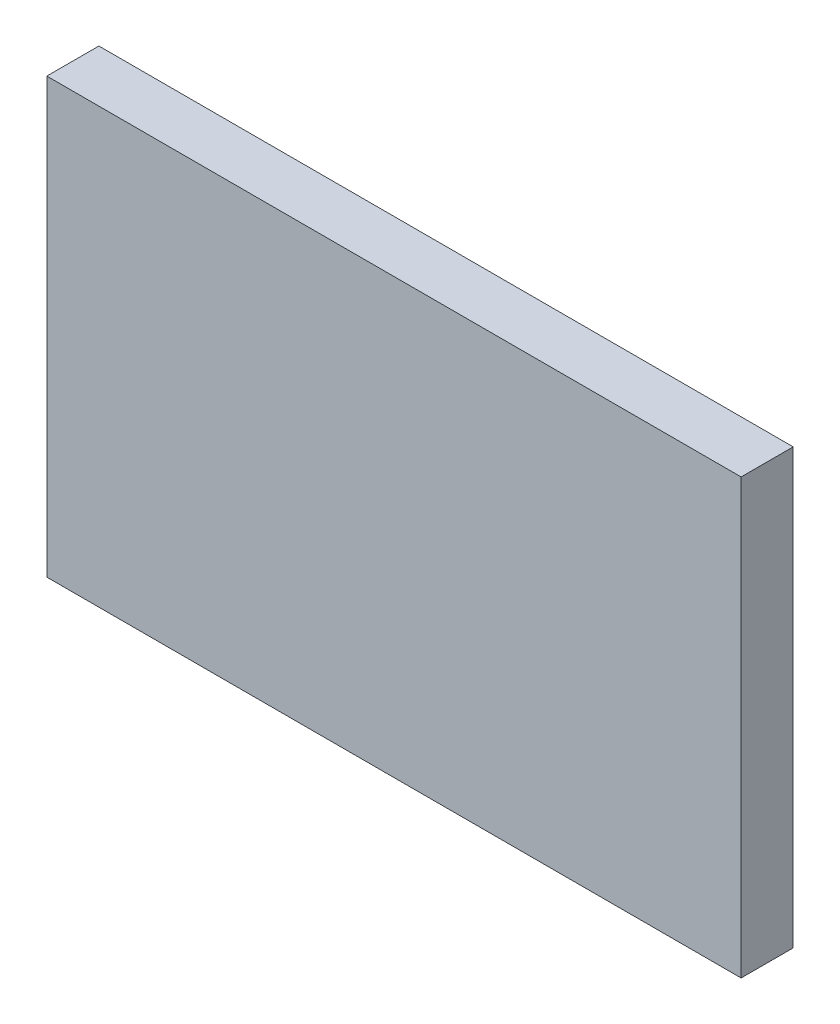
ISO-10303-21;
HEADER;
FILE_DESCRIPTION(('STEP AP214'),'2;1');
FILE_NAME('part.step','',(''),(''),'','','');
FILE_SCHEMA(('AUTOMOTIVE_DESIGN { 1 0 10303 214 1 1 1 1 }'));
ENDSEC;
DATA;
#1=APPLICATION_CONTEXT('core data for automotive mechanical design processes');
#2=APPLICATION_PROTOCOL_DEFINITION('international standard','automotive_design',2000,#1);
#3=PRODUCT_CONTEXT('',#1,'mechanical');
#4=PRODUCT('Part','Part','',(#3));
#5=PRODUCT_RELATED_PRODUCT_CATEGORY('part','',(#4));
#6=PRODUCT_DEFINITION_FORMATION('','',#4);
#7=PRODUCT_DEFINITION_CONTEXT('part definition',#1,'design');
#8=PRODUCT_DEFINITION('design','',#6,#7);
#9=PRODUCT_DEFINITION_SHAPE('','',#8);
#10=(LENGTH_UNIT() NAMED_UNIT(*) SI_UNIT(.MILLI.,.METRE.));
#11=(NAMED_UNIT(*) PLANE_ANGLE_UNIT() SI_UNIT($,.RADIAN.));
#12=(NAMED_UNIT(*) SI_UNIT($,.STERADIAN.) SOLID_ANGLE_UNIT());
#13=UNCERTAINTY_MEASURE_WITH_UNIT(LENGTH_MEASURE(1.E-05),#10,'distance_accuracy_value','');
#14=(GEOMETRIC_REPRESENTATION_CONTEXT(3) GLOBAL_UNCERTAINTY_ASSIGNED_CONTEXT((#13)) GLOBAL_UNIT_ASSIGNED_CONTEXT((#10,
#11,#12)) REPRESENTATION_CONTEXT('',''));
#15=CARTESIAN_POINT('',(0.,0.,0.));
#16=DIRECTION('',(0.,0.,1.));
#17=DIRECTION('',(1.,0.,0.));
#18=AXIS2_PLACEMENT_3D('',#15,#16,#17);
#19=CARTESIAN_POINT('',(58.42,41.275,-20.32));
#20=DIRECTION('',(1.,0.,0.));
#21=DIRECTION('',(0.,0.,-1.));
#22=AXIS2_PLACEMENT_3D('',#19,#20,#21);
#23=PLANE('',#22);
#24=DIRECTION('',(0.,0.,1.));
#25=VECTOR('',#24,1.);
#26=CARTESIAN_POINT('',(58.42,41.275,-20.32));
#27=LINE('',#26,#25);
#28=CARTESIAN_POINT('',(58.42,41.275,-15.24));
#29=VERTEX_POINT('',#28);
#30=CARTESIAN_POINT('',(58.42,41.275,-5.08));
#31=VERTEX_POINT('',#30);
#32=EDGE_CURVE('E544',#29,#31,#27,.T.);
#33=ORIENTED_EDGE('',*,*,#32,.F.);
#34=CARTESIAN_POINT('',(58.42,36.195,-15.24));
#35=DIRECTION('',(1.,0.,0.));
#36=DIRECTION('',(0.,0.,-1.));
#37=AXIS2_PLACEMENT_3D('',#34,#35,#36);
#38=CIRCLE('',#37,5.08);
#39=CARTESIAN_POINT('',(58.42,36.195,-20.32));
#40=VERTEX_POINT('',#39);
#41=EDGE_CURVE('E245',#29,#40,#38,.F.);
#42=ORIENTED_EDGE('',*,*,#41,.T.);
#43=DIRECTION('',(0.,1.,0.));
#44=VECTOR('',#43,1.);
#45=CARTESIAN_POINT('',(58.42,41.275,-20.32));
#46=LINE('',#45,#44);
#47=CARTESIAN_POINT('',(58.42,27.1108538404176,-20.32));
#48=VERTEX_POINT('',#47);
#49=EDGE_CURVE('E538',#48,#40,#46,.T.);
#50=ORIENTED_EDGE('',*,*,#49,.F.);
#51=CARTESIAN_POINT('',(58.42,27.1108538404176,-15.24));
#52=DIRECTION('',(1.,0.,0.));
#53=DIRECTION('',(0.,0.,-1.));
#54=AXIS2_PLACEMENT_3D('',#51,#52,#53);
#55=CIRCLE('',#54,5.08);
#56=CARTESIAN_POINT('',(58.42,22.0308538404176,-15.24));
#57=VERTEX_POINT('',#56);
#58=EDGE_CURVE('E243',#48,#57,#55,.F.);
#59=ORIENTED_EDGE('',*,*,#58,.T.);
#60=DIRECTION('',(0.,0.,1.));
#61=VECTOR('',#60,1.);
#62=CARTESIAN_POINT('',(58.42,22.0308538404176,-20.32));
#63=LINE('',#62,#61);
#64=CARTESIAN_POINT('',(58.42,22.0308538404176,-5.08));
#65=VERTEX_POINT('',#64);
#66=EDGE_CURVE('E198',#57,#65,#63,.T.);
#67=ORIENTED_EDGE('',*,*,#66,.T.);
#68=CARTESIAN_POINT('',(58.42,16.9508538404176,-5.08));
#69=DIRECTION('',(1.,0.,0.));
#70=DIRECTION('',(0.,0.,-1.));
#71=AXIS2_PLACEMENT_3D('',#68,#69,#70);
#72=CIRCLE('',#71,5.08);
#73=CARTESIAN_POINT('',(58.42,16.9508538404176,0.));
#74=VERTEX_POINT('',#73);
#75=EDGE_CURVE('E284',#65,#74,#72,.T.);
#76=ORIENTED_EDGE('',*,*,#75,.T.);
#77=DIRECTION('',(0.,1.,0.));
#78=VECTOR('',#77,1.);
#79=CARTESIAN_POINT('',(58.42,41.275,0.));
#80=LINE('',#79,#78);
#81=CARTESIAN_POINT('',(58.42,46.355,0.));
#82=VERTEX_POINT('',#81);
#83=EDGE_CURVE('E528',#74,#82,#80,.T.);
#84=ORIENTED_EDGE('',*,*,#83,.T.);
#85=CARTESIAN_POINT('',(58.42,46.355,-5.08));
#86=DIRECTION('',(1.,0.,0.));
#87=DIRECTION('',(0.,0.,-1.));
#88=AXIS2_PLACEMENT_3D('',#85,#86,#87);
#89=CIRCLE('',#88,5.08);
#90=EDGE_CURVE('E277',#82,#31,#89,.T.);
#91=ORIENTED_EDGE('',*,*,#90,.T.);
#92=EDGE_LOOP('',(#33,#42,#50,#59,#67,#76,#84,#91));
#93=FACE_BOUND('',#92,.T.);
#94=CARTESIAN_POINT('',(58.4200000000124,31.75,-12.7));
#95=DIRECTION('',(1.,0.,0.));
#96=DIRECTION('',(0.,0.,-1.));
#97=AXIS2_PLACEMENT_3D('',#94,#95,#96);
#98=CIRCLE('',#97,6.33033884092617);
#99=CARTESIAN_POINT('',(58.4200000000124,31.75,-19.0303388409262));
#100=VERTEX_POINT('',#99);
#101=EDGE_CURVE('E11',#100,#100,#98,.F.);
#102=ORIENTED_EDGE('',*,*,#101,.F.);
#103=EDGE_LOOP('',(#102));
#104=FACE_BOUND('',#103,.T.);
#105=ADVANCED_FACE('F30',(#93,#104),#23,.F.);
#106=CARTESIAN_POINT('',(43.18,41.275,-20.32));
#107=DIRECTION('',(-1.,0.,0.));
#108=DIRECTION('',(0.,0.,1.));
#109=AXIS2_PLACEMENT_3D('',#106,#107,#108);
#110=PLANE('',#109);
#111=DIRECTION('',(0.,-1.,0.));
#112=VECTOR('',#111,1.);
#113=CARTESIAN_POINT('',(43.18,41.275,-20.32));
#114=LINE('',#113,#112);
#115=CARTESIAN_POINT('',(43.18,36.195,-20.32));
#116=VERTEX_POINT('',#115);
#117=CARTESIAN_POINT('',(43.18,27.305,-20.32));
#118=VERTEX_POINT('',#117);
#119=EDGE_CURVE('E573',#116,#118,#114,.T.);
#120=ORIENTED_EDGE('',*,*,#119,.F.);
#121=CARTESIAN_POINT('',(43.18,36.195,-15.24));
#122=DIRECTION('',(-1.,0.,0.));
#123=DIRECTION('',(0.,0.,1.));
#124=AXIS2_PLACEMENT_3D('',#121,#122,#123);
#125=CIRCLE('',#124,5.08);
#126=CARTESIAN_POINT('',(43.18,41.275,-15.24));
#127=VERTEX_POINT('',#126);
#128=EDGE_CURVE('E255',#116,#127,#125,.F.);
#129=ORIENTED_EDGE('',*,*,#128,.T.);
#130=DIRECTION('',(0.,0.,1.));
#131=VECTOR('',#130,1.);
#132=CARTESIAN_POINT('',(43.18,41.275,-20.32));
#133=LINE('',#132,#131);
#134=CARTESIAN_POINT('',(43.18,41.275,-5.08));
#135=VERTEX_POINT('',#134);
#136=EDGE_CURVE('E567',#127,#135,#133,.T.);
#137=ORIENTED_EDGE('',*,*,#136,.T.);
#138=CARTESIAN_POINT('',(43.18,46.355,-5.08));
#139=DIRECTION('',(-1.,0.,0.));
#140=DIRECTION('',(0.,0.,1.));
#141=AXIS2_PLACEMENT_3D('',#138,#139,#140);
#142=CIRCLE('',#141,5.08);
#143=CARTESIAN_POINT('',(43.18,46.355,0.));
#144=VERTEX_POINT('',#143);
#145=EDGE_CURVE('E279',#135,#144,#142,.T.);
#146=ORIENTED_EDGE('',*,*,#145,.T.);
#147=DIRECTION('',(0.,-1.,0.));
#148=VECTOR('',#147,1.);
#149=CARTESIAN_POINT('',(43.18,41.275,0.));
#150=LINE('',#149,#148);
#151=CARTESIAN_POINT('',(43.18,17.145,0.));
#152=VERTEX_POINT('',#151);
#153=EDGE_CURVE('E523',#144,#152,#150,.T.);
#154=ORIENTED_EDGE('',*,*,#153,.T.);
#155=CARTESIAN_POINT('',(43.18,17.145,-5.08));
#156=DIRECTION('',(-1.,0.,0.));
#157=DIRECTION('',(0.,0.,1.));
#158=AXIS2_PLACEMENT_3D('',#155,#156,#157);
#159=CIRCLE('',#158,5.08);
#160=CARTESIAN_POINT('',(43.18,22.225,-5.08));
#161=VERTEX_POINT('',#160);
#162=EDGE_CURVE('E290',#152,#161,#159,.T.);
#163=ORIENTED_EDGE('',*,*,#162,.T.);
#164=DIRECTION('',(0.,0.,1.));
#165=VECTOR('',#164,1.);
#166=CARTESIAN_POINT('',(43.18,22.225,-20.32));
#167=LINE('',#166,#165);
#168=CARTESIAN_POINT('',(43.18,22.225,-15.24));
#169=VERTEX_POINT('',#168);
#170=EDGE_CURVE('E521',#169,#161,#167,.T.);
#171=ORIENTED_EDGE('',*,*,#170,.F.);
#172=CARTESIAN_POINT('',(43.18,27.305,-15.24));
#173=DIRECTION('',(-1.,0.,0.));
#174=DIRECTION('',(0.,0.,1.));
#175=AXIS2_PLACEMENT_3D('',#172,#173,#174);
#176=CIRCLE('',#175,5.08);
#177=EDGE_CURVE('E253',#169,#118,#176,.F.);
#178=ORIENTED_EDGE('',*,*,#177,.T.);
#179=EDGE_LOOP('',(#120,#129,#137,#146,#154,#163,#171,#178));
#180=FACE_BOUND('',#179,.T.);
#181=CARTESIAN_POINT('',(43.1800000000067,31.75,-12.7));
#182=DIRECTION('',(-1.,0.,0.));
#183=DIRECTION('',(0.,0.,1.));
#184=AXIS2_PLACEMENT_3D('',#181,#182,#183);
#185=CIRCLE('',#184,6.33033884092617);
#186=CARTESIAN_POINT('',(43.1800000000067,31.75,-6.36966115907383));
#187=VERTEX_POINT('',#186);
#188=EDGE_CURVE('E38',#187,#187,#185,.F.);
#189=ORIENTED_EDGE('',*,*,#188,.F.);
#190=EDGE_LOOP('',(#189));
#191=FACE_BOUND('',#190,.T.);
#192=ADVANCED_FACE('F296',(#180,#191),#110,.F.);
#193=CARTESIAN_POINT('',(0.,63.5,0.));
#194=DIRECTION('',(0.,0.,-1.));
#195=DIRECTION('',(-1.,0.,0.));
#196=AXIS2_PLACEMENT_3D('',#193,#194,#195);
#197=PLANE('',#196);
#198=DIRECTION('',(0.,-1.,0.));
#199=VECTOR('',#198,1.);
#200=CARTESIAN_POINT('',(63.5,41.275,0.));
#201=LINE('',#200,#199);
#202=CARTESIAN_POINT('',(63.5,46.355,0.));
#203=VERTEX_POINT('',#202);
#204=CARTESIAN_POINT('',(63.5,16.9508538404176,0.));
#205=VERTEX_POINT('',#204);
#206=EDGE_CURVE('E525',#203,#205,#201,.T.);
#207=ORIENTED_EDGE('',*,*,#206,.F.);
#208=DIRECTION('',(1.,0.,0.));
#209=VECTOR('',#208,1.);
#210=CARTESIAN_POINT('',(0.,46.3550000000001,0.));
#211=LINE('',#210,#209);
#212=EDGE_CURVE('E230',#203,#82,#211,.F.);
#213=ORIENTED_EDGE('',*,*,#212,.T.);
#214=ORIENTED_EDGE('',*,*,#83,.F.);
#215=DIRECTION('',(-1.,0.,0.));
#216=VECTOR('',#215,1.);
#217=CARTESIAN_POINT('',(0.,16.9508538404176,0.));
#218=LINE('',#217,#216);
#219=EDGE_CURVE('E224',#74,#205,#218,.F.);
#220=ORIENTED_EDGE('',*,*,#219,.T.);
#221=EDGE_LOOP('',(#207,#213,#214,#220));
#222=FACE_BOUND('',#221,.T.);
#223=DIRECTION('',(0.,-1.,0.));
#224=VECTOR('',#223,1.);
#225=CARTESIAN_POINT('',(0.,0.,0.));
#226=LINE('',#225,#224);
#227=CARTESIAN_POINT('',(0.,63.5,0.));
#228=VERTEX_POINT('',#227);
#229=CARTESIAN_POINT('',(0.,0.,0.));
#230=VERTEX_POINT('',#229);
#231=EDGE_CURVE('E176',#228,#230,#226,.T.);
#232=ORIENTED_EDGE('',*,*,#231,.F.);
#233=DIRECTION('',(-1.,0.,0.));
#234=VECTOR('',#233,1.);
#235=CARTESIAN_POINT('',(0.,63.5,0.));
#236=LINE('',#235,#234);
#237=CARTESIAN_POINT('',(101.6,63.5,0.));
#238=VERTEX_POINT('',#237);
#239=EDGE_CURVE('E203',#238,#228,#236,.T.);
#240=ORIENTED_EDGE('',*,*,#239,.F.);
#241=DIRECTION('',(0.,1.,0.));
#242=VECTOR('',#241,1.);
#243=CARTESIAN_POINT('',(101.6,0.,0.));
#244=LINE('',#243,#242);
#245=CARTESIAN_POINT('',(101.6,0.,0.));
#246=VERTEX_POINT('',#245);
#247=EDGE_CURVE('E177',#246,#238,#244,.T.);
#248=ORIENTED_EDGE('',*,*,#247,.F.);
#249=DIRECTION('',(1.,0.,0.));
#250=VECTOR('',#249,1.);
#251=CARTESIAN_POINT('',(0.,0.,0.));
#252=LINE('',#251,#250);
#253=EDGE_CURVE('E170',#230,#246,#252,.T.);
#254=ORIENTED_EDGE('',*,*,#253,.F.);
#255=EDGE_LOOP('',(#232,#240,#248,#254));
#256=FACE_BOUND('',#255,.T.);
#257=ORIENTED_EDGE('',*,*,#153,.F.);
#258=DIRECTION('',(1.,0.,0.));
#259=VECTOR('',#258,1.);
#260=CARTESIAN_POINT('',(0.,46.355,0.));
#261=LINE('',#260,#259);
#262=CARTESIAN_POINT('',(38.1,46.355,0.));
#263=VERTEX_POINT('',#262);
#264=EDGE_CURVE('E227',#144,#263,#261,.F.);
#265=ORIENTED_EDGE('',*,*,#264,.T.);
#266=DIRECTION('',(0.,1.,0.));
#267=VECTOR('',#266,1.);
#268=CARTESIAN_POINT('',(38.1,41.275,0.));
#269=LINE('',#268,#267);
#270=CARTESIAN_POINT('',(38.1,17.145,0.));
#271=VERTEX_POINT('',#270);
#272=EDGE_CURVE('E576',#271,#263,#269,.T.);
#273=ORIENTED_EDGE('',*,*,#272,.F.);
#274=DIRECTION('',(-1.,0.,0.));
#275=VECTOR('',#274,1.);
#276=CARTESIAN_POINT('',(0.,17.145,0.));
#277=LINE('',#276,#275);
#278=EDGE_CURVE('E221',#271,#152,#277,.F.);
#279=ORIENTED_EDGE('',*,*,#278,.T.);
#280=EDGE_LOOP('',(#257,#265,#273,#279));
#281=FACE_BOUND('',#280,.T.);
#282=ADVANCED_FACE('F172',(#222,#256,#281),#197,.T.);
#283=CARTESIAN_POINT('',(0.,0.,7.62));
#284=DIRECTION('',(1.,0.,0.));
#285=DIRECTION('',(0.,1.,0.));
#286=AXIS2_PLACEMENT_3D('',#283,#284,#285);
#287=PLANE('',#286);
#288=ORIENTED_EDGE('',*,*,#231,.T.);
#289=DIRECTION('',(0.,0.,-1.));
#290=VECTOR('',#289,1.);
#291=CARTESIAN_POINT('',(0.,0.,7.62));
#292=LINE('',#291,#290);
#293=CARTESIAN_POINT('',(0.,0.,7.62));
#294=VERTEX_POINT('',#293);
#295=EDGE_CURVE('E183',#294,#230,#292,.T.);
#296=ORIENTED_EDGE('',*,*,#295,.F.);
#297=DIRECTION('',(0.,-1.,0.));
#298=VECTOR('',#297,1.);
#299=CARTESIAN_POINT('',(0.,0.,7.62));
#300=LINE('',#299,#298);
#301=CARTESIAN_POINT('',(0.,63.5,7.62));
#302=VERTEX_POINT('',#301);
#303=EDGE_CURVE('E205',#302,#294,#300,.T.);
#304=ORIENTED_EDGE('',*,*,#303,.F.);
#305=DIRECTION('',(0.,0.,-1.));
#306=VECTOR('',#305,1.);
#307=CARTESIAN_POINT('',(0.,63.5,7.62));
#308=LINE('',#307,#306);
#309=EDGE_CURVE('E194',#302,#228,#308,.T.);
#310=ORIENTED_EDGE('',*,*,#309,.T.);
#311=EDGE_LOOP('',(#288,#296,#304,#310));
#312=FACE_BOUND('',#311,.T.);
#313=ADVANCED_FACE('F32',(#312),#287,.F.);
#314=CARTESIAN_POINT('',(0.,0.,7.62));
#315=DIRECTION('',(0.,1.,0.));
#316=DIRECTION('',(0.,0.,1.));
#317=AXIS2_PLACEMENT_3D('',#314,#315,#316);
#318=PLANE('',#317);
#319=ORIENTED_EDGE('',*,*,#253,.T.);
#320=DIRECTION('',(0.,0.,-1.));
#321=VECTOR('',#320,1.);
#322=CARTESIAN_POINT('',(101.6,0.,7.62));
#323=LINE('',#322,#321);
#324=CARTESIAN_POINT('',(101.6,0.,7.62));
#325=VERTEX_POINT('',#324);
#326=EDGE_CURVE('E190',#325,#246,#323,.T.);
#327=ORIENTED_EDGE('',*,*,#326,.F.);
#328=DIRECTION('',(1.,0.,0.));
#329=VECTOR('',#328,1.);
#330=CARTESIAN_POINT('',(0.,0.,7.62));
#331=LINE('',#330,#329);
#332=EDGE_CURVE('E185',#294,#325,#331,.T.);
#333=ORIENTED_EDGE('',*,*,#332,.F.);
#334=ORIENTED_EDGE('',*,*,#295,.T.);
#335=EDGE_LOOP('',(#319,#327,#333,#334));
#336=FACE_BOUND('',#335,.T.);
#337=ADVANCED_FACE('F184',(#336),#318,.F.);
#338=CARTESIAN_POINT('',(101.6,0.,7.62));
#339=DIRECTION('',(-1.,0.,0.));
#340=DIRECTION('',(0.,-1.,0.));
#341=AXIS2_PLACEMENT_3D('',#338,#339,#340);
#342=PLANE('',#341);
#343=ORIENTED_EDGE('',*,*,#247,.T.);
#344=DIRECTION('',(0.,0.,-1.));
#345=VECTOR('',#344,1.);
#346=CARTESIAN_POINT('',(101.6,63.5,7.62));
#347=LINE('',#346,#345);
#348=CARTESIAN_POINT('',(101.6,63.5,7.62));
#349=VERTEX_POINT('',#348);
#350=EDGE_CURVE('E213',#349,#238,#347,.T.);
#351=ORIENTED_EDGE('',*,*,#350,.F.);
#352=DIRECTION('',(0.,1.,0.));
#353=VECTOR('',#352,1.);
#354=CARTESIAN_POINT('',(101.6,0.,7.62));
#355=LINE('',#354,#353);
#356=EDGE_CURVE('E208',#325,#349,#355,.T.);
#357=ORIENTED_EDGE('',*,*,#356,.F.);
#358=ORIENTED_EDGE('',*,*,#326,.T.);
#359=EDGE_LOOP('',(#343,#351,#357,#358));
#360=FACE_BOUND('',#359,.T.);
#361=ADVANCED_FACE('F336',(#360),#342,.F.);
#362=CARTESIAN_POINT('',(0.,63.5,7.62));
#363=DIRECTION('',(0.,-1.,0.));
#364=DIRECTION('',(0.,0.,-1.));
#365=AXIS2_PLACEMENT_3D('',#362,#363,#364);
#366=PLANE('',#365);
#367=ORIENTED_EDGE('',*,*,#239,.T.);
#368=ORIENTED_EDGE('',*,*,#309,.F.);
#369=DIRECTION('',(-1.,0.,0.));
#370=VECTOR('',#369,1.);
#371=CARTESIAN_POINT('',(0.,63.5,7.62));
#372=LINE('',#371,#370);
#373=EDGE_CURVE('E210',#349,#302,#372,.T.);
#374=ORIENTED_EDGE('',*,*,#373,.F.);
#375=ORIENTED_EDGE('',*,*,#350,.T.);
#376=EDGE_LOOP('',(#367,#368,#374,#375));
#377=FACE_BOUND('',#376,.T.);
#378=ADVANCED_FACE('F332',(#377),#366,.F.);
#379=CARTESIAN_POINT('',(0.,63.5,7.62));
#380=DIRECTION('',(0.,0.,-1.));
#381=DIRECTION('',(-1.,0.,0.));
#382=AXIS2_PLACEMENT_3D('',#379,#380,#381);
#383=PLANE('',#382);
#384=ORIENTED_EDGE('',*,*,#303,.T.);
#385=ORIENTED_EDGE('',*,*,#332,.T.);
#386=ORIENTED_EDGE('',*,*,#356,.T.);
#387=ORIENTED_EDGE('',*,*,#373,.T.);
#388=EDGE_LOOP('',(#384,#385,#386,#387));
#389=FACE_BOUND('',#388,.T.);
#390=ADVANCED_FACE('F327',(#389),#383,.F.);
#391=CARTESIAN_POINT('',(63.5,41.275,-20.32));
#392=DIRECTION('',(-1.,0.,0.));
#393=DIRECTION('',(0.,0.,1.));
#394=AXIS2_PLACEMENT_3D('',#391,#392,#393);
#395=PLANE('',#394);
#396=DIRECTION('',(0.,-1.,0.));
#397=VECTOR('',#396,1.);
#398=CARTESIAN_POINT('',(63.5,41.275,-20.32));
#399=LINE('',#398,#397);
#400=CARTESIAN_POINT('',(63.5,36.195,-20.32));
#401=VERTEX_POINT('',#400);
#402=CARTESIAN_POINT('',(63.5,27.1108538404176,-20.32));
#403=VERTEX_POINT('',#402);
#404=EDGE_CURVE('E535',#401,#403,#399,.T.);
#405=ORIENTED_EDGE('',*,*,#404,.F.);
#406=CARTESIAN_POINT('',(63.5,36.195,-15.24));
#407=DIRECTION('',(-1.,0.,0.));
#408=DIRECTION('',(0.,0.,1.));
#409=AXIS2_PLACEMENT_3D('',#406,#407,#408);
#410=CIRCLE('',#409,5.08);
#411=CARTESIAN_POINT('',(63.5,41.275,-15.24));
#412=VERTEX_POINT('',#411);
#413=EDGE_CURVE('E241',#401,#412,#410,.F.);
#414=ORIENTED_EDGE('',*,*,#413,.T.);
#415=DIRECTION('',(0.,0.,1.));
#416=VECTOR('',#415,1.);
#417=CARTESIAN_POINT('',(63.5,41.275,-20.32));
#418=LINE('',#417,#416);
#419=CARTESIAN_POINT('',(63.5,41.275,-5.08));
#420=VERTEX_POINT('',#419);
#421=EDGE_CURVE('E541',#412,#420,#418,.T.);
#422=ORIENTED_EDGE('',*,*,#421,.T.);
#423=CARTESIAN_POINT('',(63.5,46.355,-5.08));
#424=DIRECTION('',(-1.,0.,0.));
#425=DIRECTION('',(0.,0.,1.));
#426=AXIS2_PLACEMENT_3D('',#423,#424,#425);
#427=CIRCLE('',#426,5.08);
#428=EDGE_CURVE('E274',#420,#203,#427,.T.);
#429=ORIENTED_EDGE('',*,*,#428,.T.);
#430=ORIENTED_EDGE('',*,*,#206,.T.);
#431=CARTESIAN_POINT('',(63.5,16.9508538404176,-5.08));
#432=DIRECTION('',(-1.,0.,0.));
#433=DIRECTION('',(0.,0.,1.));
#434=AXIS2_PLACEMENT_3D('',#431,#432,#433);
#435=CIRCLE('',#434,5.08);
#436=CARTESIAN_POINT('',(63.5,22.0308538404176,-5.08));
#437=VERTEX_POINT('',#436);
#438=EDGE_CURVE('E287',#205,#437,#435,.T.);
#439=ORIENTED_EDGE('',*,*,#438,.T.);
#440=DIRECTION('',(0.,0.,1.));
#441=VECTOR('',#440,1.);
#442=CARTESIAN_POINT('',(63.5,22.0308538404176,-20.32));
#443=LINE('',#442,#441);
#444=CARTESIAN_POINT('',(63.5,22.0308538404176,-15.24));
#445=VERTEX_POINT('',#444);
#446=EDGE_CURVE('E195',#445,#437,#443,.T.);
#447=ORIENTED_EDGE('',*,*,#446,.F.);
#448=CARTESIAN_POINT('',(63.5,27.1108538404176,-15.24));
#449=DIRECTION('',(-1.,0.,0.));
#450=DIRECTION('',(0.,0.,1.));
#451=AXIS2_PLACEMENT_3D('',#448,#449,#450);
#452=CIRCLE('',#451,5.08);
#453=EDGE_CURVE('E239',#445,#403,#452,.F.);
#454=ORIENTED_EDGE('',*,*,#453,.T.);
#455=EDGE_LOOP('',(#405,#414,#422,#429,#430,#439,#447,#454));
#456=FACE_BOUND('',#455,.T.);
#457=ADVANCED_FACE('F324',(#456),#395,.F.);
#458=CARTESIAN_POINT('',(63.5,22.0308538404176,-20.32));
#459=DIRECTION('',(0.,1.,0.));
#460=DIRECTION('',(0.,0.,1.));
#461=AXIS2_PLACEMENT_3D('',#458,#459,#460);
#462=PLANE('',#461);
#463=ORIENTED_EDGE('',*,*,#446,.T.);
#464=DIRECTION('',(-1.,0.,0.));
#465=VECTOR('',#464,1.);
#466=CARTESIAN_POINT('',(63.5,22.0308538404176,-5.08));
#467=LINE('',#466,#465);
#468=EDGE_CURVE('E267',#437,#65,#467,.T.);
#469=ORIENTED_EDGE('',*,*,#468,.T.);
#470=ORIENTED_EDGE('',*,*,#66,.F.);
#471=DIRECTION('',(-1.,0.,0.));
#472=VECTOR('',#471,1.);
#473=CARTESIAN_POINT('',(63.5,22.0308538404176,-15.24));
#474=LINE('',#473,#472);
#475=EDGE_CURVE('E265',#57,#445,#474,.F.);
#476=ORIENTED_EDGE('',*,*,#475,.T.);
#477=EDGE_LOOP('',(#463,#469,#470,#476));
#478=FACE_BOUND('',#477,.T.);
#479=ADVANCED_FACE('F319',(#478),#462,.F.);
#480=CARTESIAN_POINT('',(63.5,41.275,-20.32));
#481=DIRECTION('',(0.,-1.,0.));
#482=DIRECTION('',(1.,0.,0.));
#483=AXIS2_PLACEMENT_3D('',#480,#481,#482);
#484=PLANE('',#483);
#485=ORIENTED_EDGE('',*,*,#32,.T.);
#486=DIRECTION('',(1.,0.,0.));
#487=VECTOR('',#486,1.);
#488=CARTESIAN_POINT('',(63.5,41.275,-5.08));
#489=LINE('',#488,#487);
#490=EDGE_CURVE('E218',#31,#420,#489,.T.);
#491=ORIENTED_EDGE('',*,*,#490,.T.);
#492=ORIENTED_EDGE('',*,*,#421,.F.);
#493=DIRECTION('',(1.,0.,0.));
#494=VECTOR('',#493,1.);
#495=CARTESIAN_POINT('',(58.42,41.275,-15.24));
#496=LINE('',#495,#494);
#497=EDGE_CURVE('E189',#412,#29,#496,.F.);
#498=ORIENTED_EDGE('',*,*,#497,.T.);
#499=EDGE_LOOP('',(#485,#491,#492,#498));
#500=FACE_BOUND('',#499,.T.);
#501=ADVANCED_FACE('F316',(#500),#484,.F.);
#502=CARTESIAN_POINT('',(63.5,22.0308538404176,-20.32));
#503=DIRECTION('',(0.,0.,-1.));
#504=DIRECTION('',(-1.,0.,0.));
#505=AXIS2_PLACEMENT_3D('',#502,#503,#504);
#506=PLANE('',#505);
#507=ORIENTED_EDGE('',*,*,#49,.T.);
#508=DIRECTION('',(1.,0.,0.));
#509=VECTOR('',#508,1.);
#510=CARTESIAN_POINT('',(63.5,36.195,-20.32));
#511=LINE('',#510,#509);
#512=EDGE_CURVE('E236',#40,#401,#511,.T.);
#513=ORIENTED_EDGE('',*,*,#512,.T.);
#514=ORIENTED_EDGE('',*,*,#404,.T.);
#515=DIRECTION('',(-1.,0.,0.));
#516=VECTOR('',#515,1.);
#517=CARTESIAN_POINT('',(58.42,27.1108538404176,-20.32));
#518=LINE('',#517,#516);
#519=EDGE_CURVE('E233',#403,#48,#518,.T.);
#520=ORIENTED_EDGE('',*,*,#519,.T.);
#521=EDGE_LOOP('',(#507,#513,#514,#520));
#522=FACE_BOUND('',#521,.T.);
#523=ADVANCED_FACE('F313',(#522),#506,.T.);
#524=CARTESIAN_POINT('',(43.18,22.225,-20.32));
#525=DIRECTION('',(0.,1.,0.));
#526=DIRECTION('',(0.,0.,1.));
#527=AXIS2_PLACEMENT_3D('',#524,#525,#526);
#528=PLANE('',#527);
#529=DIRECTION('',(0.,0.,1.));
#530=VECTOR('',#529,1.);
#531=CARTESIAN_POINT('',(38.1,22.225,-20.32));
#532=LINE('',#531,#530);
#533=CARTESIAN_POINT('',(38.1,22.225,-15.24));
#534=VERTEX_POINT('',#533);
#535=CARTESIAN_POINT('',(38.1,22.225,-5.08));
#536=VERTEX_POINT('',#535);
#537=EDGE_CURVE('E526',#534,#536,#532,.T.);
#538=ORIENTED_EDGE('',*,*,#537,.F.);
#539=DIRECTION('',(-1.,0.,0.));
#540=VECTOR('',#539,1.);
#541=CARTESIAN_POINT('',(43.18,22.225,-15.24));
#542=LINE('',#541,#540);
#543=EDGE_CURVE('E272',#534,#169,#542,.F.);
#544=ORIENTED_EDGE('',*,*,#543,.T.);
#545=ORIENTED_EDGE('',*,*,#170,.T.);
#546=DIRECTION('',(-1.,0.,0.));
#547=VECTOR('',#546,1.);
#548=CARTESIAN_POINT('',(43.18,22.225,-5.08));
#549=LINE('',#548,#547);
#550=EDGE_CURVE('E270',#161,#536,#549,.T.);
#551=ORIENTED_EDGE('',*,*,#550,.T.);
#552=EDGE_LOOP('',(#538,#544,#545,#551));
#553=FACE_BOUND('',#552,.T.);
#554=ADVANCED_FACE('F311',(#553),#528,.F.);
#555=CARTESIAN_POINT('',(38.1,41.275,-20.32));
#556=DIRECTION('',(1.,0.,0.));
#557=DIRECTION('',(0.,1.,0.));
#558=AXIS2_PLACEMENT_3D('',#555,#556,#557);
#559=PLANE('',#558);
#560=DIRECTION('',(0.,0.,1.));
#561=VECTOR('',#560,1.);
#562=CARTESIAN_POINT('',(38.1,41.275,-20.32));
#563=LINE('',#562,#561);
#564=CARTESIAN_POINT('',(38.1,41.275,-15.24));
#565=VERTEX_POINT('',#564);
#566=CARTESIAN_POINT('',(38.1,41.275,-5.08));
#567=VERTEX_POINT('',#566);
#568=EDGE_CURVE('E530',#565,#567,#563,.T.);
#569=ORIENTED_EDGE('',*,*,#568,.F.);
#570=CARTESIAN_POINT('',(38.1,36.195,-15.24));
#571=DIRECTION('',(1.,0.,0.));
#572=DIRECTION('',(0.,1.,0.));
#573=AXIS2_PLACEMENT_3D('',#570,#571,#572);
#574=CIRCLE('',#573,5.08);
#575=CARTESIAN_POINT('',(38.1,36.195,-20.32));
#576=VERTEX_POINT('',#575);
#577=EDGE_CURVE('E263',#565,#576,#574,.F.);
#578=ORIENTED_EDGE('',*,*,#577,.T.);
#579=DIRECTION('',(0.,1.,0.));
#580=VECTOR('',#579,1.);
#581=CARTESIAN_POINT('',(38.1,41.275,-20.32));
#582=LINE('',#581,#580);
#583=CARTESIAN_POINT('',(38.1,27.305,-20.32));
#584=VERTEX_POINT('',#583);
#585=EDGE_CURVE('E570',#584,#576,#582,.T.);
#586=ORIENTED_EDGE('',*,*,#585,.F.);
#587=CARTESIAN_POINT('',(38.1,27.305,-15.24));
#588=DIRECTION('',(1.,0.,0.));
#589=DIRECTION('',(0.,1.,0.));
#590=AXIS2_PLACEMENT_3D('',#587,#588,#589);
#591=CIRCLE('',#590,5.08);
#592=EDGE_CURVE('E53',#584,#534,#591,.F.);
#593=ORIENTED_EDGE('',*,*,#592,.T.);
#594=ORIENTED_EDGE('',*,*,#537,.T.);
#595=CARTESIAN_POINT('',(38.1,17.145,-5.08));
#596=DIRECTION('',(1.,0.,0.));
#597=DIRECTION('',(0.,1.,0.));
#598=AXIS2_PLACEMENT_3D('',#595,#596,#597);
#599=CIRCLE('',#598,5.08);
#600=EDGE_CURVE('E45',#536,#271,#599,.T.);
#601=ORIENTED_EDGE('',*,*,#600,.T.);
#602=ORIENTED_EDGE('',*,*,#272,.T.);
#603=CARTESIAN_POINT('',(38.1,46.355,-5.08));
#604=DIRECTION('',(1.,0.,0.));
#605=DIRECTION('',(0.,1.,0.));
#606=AXIS2_PLACEMENT_3D('',#603,#604,#605);
#607=CIRCLE('',#606,5.08);
#608=EDGE_CURVE('E282',#263,#567,#607,.T.);
#609=ORIENTED_EDGE('',*,*,#608,.T.);
#610=EDGE_LOOP('',(#569,#578,#586,#593,#594,#601,#602,#609));
#611=FACE_BOUND('',#610,.T.);
#612=ADVANCED_FACE('F387',(#611),#559,.F.);
#613=CARTESIAN_POINT('',(43.18,41.275,-20.32));
#614=DIRECTION('',(0.,-1.,0.));
#615=DIRECTION('',(0.,0.,-1.));
#616=AXIS2_PLACEMENT_3D('',#613,#614,#615);
#617=PLANE('',#616);
#618=ORIENTED_EDGE('',*,*,#136,.F.);
#619=DIRECTION('',(1.,0.,0.));
#620=VECTOR('',#619,1.);
#621=CARTESIAN_POINT('',(38.1,41.275,-15.24));
#622=LINE('',#621,#620);
#623=EDGE_CURVE('E260',#127,#565,#622,.F.);
#624=ORIENTED_EDGE('',*,*,#623,.T.);
#625=ORIENTED_EDGE('',*,*,#568,.T.);
#626=DIRECTION('',(1.,0.,0.));
#627=VECTOR('',#626,1.);
#628=CARTESIAN_POINT('',(43.18,41.275,-5.08));
#629=LINE('',#628,#627);
#630=EDGE_CURVE('E257',#567,#135,#629,.T.);
#631=ORIENTED_EDGE('',*,*,#630,.T.);
#632=EDGE_LOOP('',(#618,#624,#625,#631));
#633=FACE_BOUND('',#632,.T.);
#634=ADVANCED_FACE('F396',(#633),#617,.F.);
#635=CARTESIAN_POINT('',(43.18,22.225,-20.32));
#636=DIRECTION('',(0.,0.,-1.));
#637=DIRECTION('',(-1.,0.,0.));
#638=AXIS2_PLACEMENT_3D('',#635,#636,#637);
#639=PLANE('',#638);
#640=ORIENTED_EDGE('',*,*,#585,.T.);
#641=DIRECTION('',(1.,0.,0.));
#642=VECTOR('',#641,1.);
#643=CARTESIAN_POINT('',(43.18,36.195,-20.32));
#644=LINE('',#643,#642);
#645=EDGE_CURVE('E250',#576,#116,#644,.T.);
#646=ORIENTED_EDGE('',*,*,#645,.T.);
#647=ORIENTED_EDGE('',*,*,#119,.T.);
#648=DIRECTION('',(-1.,0.,0.));
#649=VECTOR('',#648,1.);
#650=CARTESIAN_POINT('',(38.1,27.305,-20.32));
#651=LINE('',#650,#649);
#652=EDGE_CURVE('E247',#118,#584,#651,.T.);
#653=ORIENTED_EDGE('',*,*,#652,.T.);
#654=EDGE_LOOP('',(#640,#646,#647,#653));
#655=FACE_BOUND('',#654,.T.);
#656=ADVANCED_FACE('F404',(#655),#639,.T.);
#657=CARTESIAN_POINT('',(63.5,46.355,-5.08));
#658=DIRECTION('',(1.,0.,0.));
#659=DIRECTION('',(0.,1.,0.));
#660=AXIS2_PLACEMENT_3D('',#657,#658,#659);
#661=CYLINDRICAL_SURFACE('',#660,5.08);
#662=ORIENTED_EDGE('',*,*,#90,.F.);
#663=ORIENTED_EDGE('',*,*,#212,.F.);
#664=ORIENTED_EDGE('',*,*,#428,.F.);
#665=ORIENTED_EDGE('',*,*,#490,.F.);
#666=EDGE_LOOP('',(#662,#663,#664,#665));
#667=FACE_BOUND('',#666,.T.);
#668=ADVANCED_FACE('F414',(#667),#661,.F.);
#669=CARTESIAN_POINT('',(63.5,36.195,-15.24));
#670=DIRECTION('',(-1.,0.,0.));
#671=DIRECTION('',(0.,-1.,0.));
#672=AXIS2_PLACEMENT_3D('',#669,#670,#671);
#673=CYLINDRICAL_SURFACE('',#672,5.08);
#674=ORIENTED_EDGE('',*,*,#41,.F.);
#675=ORIENTED_EDGE('',*,*,#497,.F.);
#676=ORIENTED_EDGE('',*,*,#413,.F.);
#677=ORIENTED_EDGE('',*,*,#512,.F.);
#678=EDGE_LOOP('',(#674,#675,#676,#677));
#679=FACE_BOUND('',#678,.T.);
#680=ADVANCED_FACE('F424',(#679),#673,.T.);
#681=CARTESIAN_POINT('',(43.18,36.195,-15.24));
#682=DIRECTION('',(-1.,0.,0.));
#683=DIRECTION('',(0.,0.,1.));
#684=AXIS2_PLACEMENT_3D('',#681,#682,#683);
#685=CYLINDRICAL_SURFACE('',#684,5.08);
#686=ORIENTED_EDGE('',*,*,#577,.F.);
#687=ORIENTED_EDGE('',*,*,#623,.F.);
#688=ORIENTED_EDGE('',*,*,#128,.F.);
#689=ORIENTED_EDGE('',*,*,#645,.F.);
#690=EDGE_LOOP('',(#686,#687,#688,#689));
#691=FACE_BOUND('',#690,.T.);
#692=ADVANCED_FACE('F434',(#691),#685,.T.);
#693=CARTESIAN_POINT('',(43.18,46.355,-5.08));
#694=DIRECTION('',(1.,0.,0.));
#695=DIRECTION('',(0.,0.,-1.));
#696=AXIS2_PLACEMENT_3D('',#693,#694,#695);
#697=CYLINDRICAL_SURFACE('',#696,5.08);
#698=ORIENTED_EDGE('',*,*,#608,.F.);
#699=ORIENTED_EDGE('',*,*,#264,.F.);
#700=ORIENTED_EDGE('',*,*,#145,.F.);
#701=ORIENTED_EDGE('',*,*,#630,.F.);
#702=EDGE_LOOP('',(#698,#699,#700,#701));
#703=FACE_BOUND('',#702,.T.);
#704=ADVANCED_FACE('F444',(#703),#697,.F.);
#705=CARTESIAN_POINT('',(63.5,16.9508538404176,-5.08));
#706=DIRECTION('',(-1.,0.,0.));
#707=DIRECTION('',(0.,0.,1.));
#708=AXIS2_PLACEMENT_3D('',#705,#706,#707);
#709=CYLINDRICAL_SURFACE('',#708,5.08);
#710=ORIENTED_EDGE('',*,*,#438,.F.);
#711=ORIENTED_EDGE('',*,*,#219,.F.);
#712=ORIENTED_EDGE('',*,*,#75,.F.);
#713=ORIENTED_EDGE('',*,*,#468,.F.);
#714=EDGE_LOOP('',(#710,#711,#712,#713));
#715=FACE_BOUND('',#714,.T.);
#716=ADVANCED_FACE('F454',(#715),#709,.F.);
#717=CARTESIAN_POINT('',(63.5,27.1108538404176,-15.24));
#718=DIRECTION('',(1.,0.,0.));
#719=DIRECTION('',(0.,0.,-1.));
#720=AXIS2_PLACEMENT_3D('',#717,#718,#719);
#721=CYLINDRICAL_SURFACE('',#720,5.08);
#722=ORIENTED_EDGE('',*,*,#453,.F.);
#723=ORIENTED_EDGE('',*,*,#475,.F.);
#724=ORIENTED_EDGE('',*,*,#58,.F.);
#725=ORIENTED_EDGE('',*,*,#519,.F.);
#726=EDGE_LOOP('',(#722,#723,#724,#725));
#727=FACE_BOUND('',#726,.T.);
#728=ADVANCED_FACE('F464',(#727),#721,.T.);
#729=CARTESIAN_POINT('',(43.18,27.305,-15.24));
#730=DIRECTION('',(1.,0.,0.));
#731=DIRECTION('',(0.,0.,-1.));
#732=AXIS2_PLACEMENT_3D('',#729,#730,#731);
#733=CYLINDRICAL_SURFACE('',#732,5.08);
#734=ORIENTED_EDGE('',*,*,#177,.F.);
#735=ORIENTED_EDGE('',*,*,#543,.F.);
#736=ORIENTED_EDGE('',*,*,#592,.F.);
#737=ORIENTED_EDGE('',*,*,#652,.F.);
#738=EDGE_LOOP('',(#734,#735,#736,#737));
#739=FACE_BOUND('',#738,.T.);
#740=ADVANCED_FACE('F474',(#739),#733,.T.);
#741=CARTESIAN_POINT('',(43.18,17.145,-5.08));
#742=DIRECTION('',(-1.,0.,0.));
#743=DIRECTION('',(0.,0.,1.));
#744=AXIS2_PLACEMENT_3D('',#741,#742,#743);
#745=CYLINDRICAL_SURFACE('',#744,5.08);
#746=ORIENTED_EDGE('',*,*,#162,.F.);
#747=ORIENTED_EDGE('',*,*,#278,.F.);
#748=ORIENTED_EDGE('',*,*,#600,.F.);
#749=ORIENTED_EDGE('',*,*,#550,.F.);
#750=EDGE_LOOP('',(#746,#747,#748,#749));
#751=FACE_BOUND('',#750,.T.);
#752=ADVANCED_FACE('F484',(#751),#745,.F.);
#753=CARTESIAN_POINT('',(-500000.,31.75,-12.7));
#754=DIRECTION('',(1.,0.,0.));
#755=DIRECTION('',(0.,0.,-1.));
#756=AXIS2_PLACEMENT_3D('',#753,#754,#755);
#757=CYLINDRICAL_SURFACE('',#756,6.33033884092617);
#758=ORIENTED_EDGE('',*,*,#101,.T.);
#759=EDGE_LOOP('',(#758));
#760=FACE_BOUND('',#759,.T.);
#761=ORIENTED_EDGE('',*,*,#188,.T.);
#762=EDGE_LOOP('',(#761));
#763=FACE_BOUND('',#762,.T.);
#764=ADVANCED_FACE('F294',(#760,#763),#757,.T.);
#765=CLOSED_SHELL('',(#105,#192,#282,#313,#337,#361,#378,#390,#457,#479,#501,#523,#554,#612,
#634,#656,#668,#680,#692,#704,#716,#728,#740,#752,#764));
#766=MANIFOLD_SOLID_BREP('B2',#765);
#767=ADVANCED_BREP_SHAPE_REPRESENTATION('',(#18,#766),#14);
#768=SHAPE_DEFINITION_REPRESENTATION(#9,#767);
ENDSEC;
END-ISO-10303-21;
